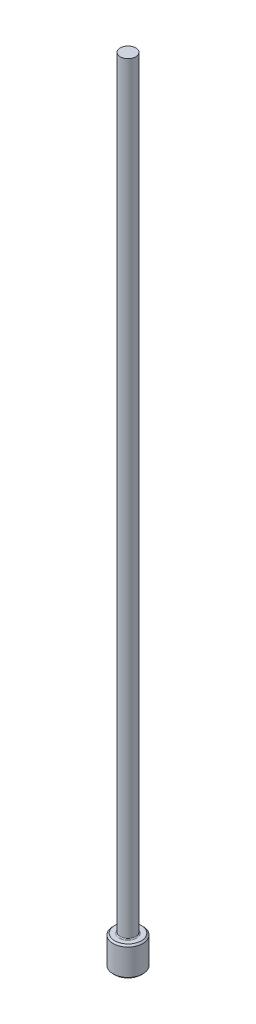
ISO-10303-21;
HEADER;
FILE_DESCRIPTION(('STEP AP214'),'2;1');
FILE_NAME('part.step','',(''),(''),'','','');
FILE_SCHEMA(('AUTOMOTIVE_DESIGN { 1 0 10303 214 1 1 1 1 }'));
ENDSEC;
DATA;
#1=APPLICATION_CONTEXT('core data for automotive mechanical design processes');
#2=APPLICATION_PROTOCOL_DEFINITION('international standard','automotive_design',2000,#1);
#3=PRODUCT_CONTEXT('',#1,'mechanical');
#4=PRODUCT('Part','Part','',(#3));
#5=PRODUCT_RELATED_PRODUCT_CATEGORY('part','',(#4));
#6=PRODUCT_DEFINITION_FORMATION('','',#4);
#7=PRODUCT_DEFINITION_CONTEXT('part definition',#1,'design');
#8=PRODUCT_DEFINITION('design','',#6,#7);
#9=PRODUCT_DEFINITION_SHAPE('','',#8);
#10=(LENGTH_UNIT() NAMED_UNIT(*) SI_UNIT(.MILLI.,.METRE.));
#11=(NAMED_UNIT(*) PLANE_ANGLE_UNIT() SI_UNIT($,.RADIAN.));
#12=(NAMED_UNIT(*) SI_UNIT($,.STERADIAN.) SOLID_ANGLE_UNIT());
#13=UNCERTAINTY_MEASURE_WITH_UNIT(LENGTH_MEASURE(1.E-05),#10,'distance_accuracy_value','');
#14=(GEOMETRIC_REPRESENTATION_CONTEXT(3) GLOBAL_UNCERTAINTY_ASSIGNED_CONTEXT((#13)) GLOBAL_UNIT_ASSIGNED_CONTEXT((#10,
#11,#12)) REPRESENTATION_CONTEXT('',''));
#15=CARTESIAN_POINT('',(0.,0.,0.));
#16=DIRECTION('',(0.,0.,1.));
#17=DIRECTION('',(1.,0.,0.));
#18=AXIS2_PLACEMENT_3D('',#15,#16,#17);
#19=CARTESIAN_POINT('',(0.,0.,0.));
#20=DIRECTION('',(0.,-1.,0.));
#21=DIRECTION('',(0.,0.,-1.));
#22=AXIS2_PLACEMENT_3D('',#19,#20,#21);
#23=PLANE('',#22);
#24=CARTESIAN_POINT('',(0.,0.,0.));
#25=DIRECTION('',(0.,-1.,0.));
#26=DIRECTION('',(0.,0.,-1.));
#27=AXIS2_PLACEMENT_3D('',#24,#25,#26);
#28=CIRCLE('',#27,1.06679999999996);
#29=CARTESIAN_POINT('',(0.,0.,-1.06679999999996));
#30=VERTEX_POINT('',#29);
#31=EDGE_CURVE('E46',#30,#30,#28,.T.);
#32=ORIENTED_EDGE('',*,*,#31,.T.);
#33=EDGE_LOOP('',(#32));
#34=FACE_BOUND('',#33,.T.);
#35=ADVANCED_FACE('F35',(#34),#23,.T.);
#36=CARTESIAN_POINT('',(0.,259.958771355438,0.));
#37=DIRECTION('',(0.,1.,0.));
#38=DIRECTION('',(0.,0.,1.));
#39=AXIS2_PLACEMENT_3D('',#36,#37,#38);
#40=CYLINDRICAL_SURFACE('',#39,1.19379999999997);
#41=CARTESIAN_POINT('',(0.,2.23519999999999,0.));
#42=DIRECTION('',(0.,1.,0.));
#43=DIRECTION('',(0.,0.,1.));
#44=AXIS2_PLACEMENT_3D('',#41,#42,#43);
#45=CIRCLE('',#44,1.19379999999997);
#46=CARTESIAN_POINT('',(0.,2.23519999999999,1.19379999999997));
#47=VERTEX_POINT('',#46);
#48=EDGE_CURVE('E50',#47,#47,#45,.F.);
#49=ORIENTED_EDGE('',*,*,#48,.T.);
#50=EDGE_LOOP('',(#49));
#51=FACE_BOUND('',#50,.T.);
#52=CARTESIAN_POINT('',(0.,0.126999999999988,0.));
#53=DIRECTION('',(0.,-1.,0.));
#54=DIRECTION('',(0.,0.,-1.));
#55=AXIS2_PLACEMENT_3D('',#52,#53,#54);
#56=CIRCLE('',#55,1.19379999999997);
#57=CARTESIAN_POINT('',(0.,0.126999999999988,-1.19379999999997));
#58=VERTEX_POINT('',#57);
#59=EDGE_CURVE('E55',#58,#58,#56,.F.);
#60=ORIENTED_EDGE('',*,*,#59,.T.);
#61=EDGE_LOOP('',(#60));
#62=FACE_BOUND('',#61,.T.);
#63=ADVANCED_FACE('F77',(#51,#62),#40,.T.);
#64=CARTESIAN_POINT('',(-1.19379999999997,2.3622,0.));
#65=DIRECTION('',(0.,1.,0.));
#66=DIRECTION('',(0.,0.,1.));
#67=AXIS2_PLACEMENT_3D('',#64,#65,#66);
#68=PLANE('',#67);
#69=CARTESIAN_POINT('',(0.,2.3622,0.));
#70=DIRECTION('',(0.,1.,0.));
#71=DIRECTION('',(0.,0.,1.));
#72=AXIS2_PLACEMENT_3D('',#69,#70,#71);
#73=CIRCLE('',#72,0.698499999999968);
#74=CARTESIAN_POINT('',(0.,2.3622,0.698499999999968));
#75=VERTEX_POINT('',#74);
#76=EDGE_CURVE('E10',#75,#75,#73,.F.);
#77=ORIENTED_EDGE('',*,*,#76,.T.);
#78=EDGE_LOOP('',(#77));
#79=FACE_BOUND('',#78,.T.);
#80=CARTESIAN_POINT('',(0.,2.3622,0.));
#81=DIRECTION('',(0.,1.,0.));
#82=DIRECTION('',(0.,0.,1.));
#83=AXIS2_PLACEMENT_3D('',#80,#81,#82);
#84=CIRCLE('',#83,1.06679999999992);
#85=CARTESIAN_POINT('',(0.,2.3622,1.06679999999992));
#86=VERTEX_POINT('',#85);
#87=EDGE_CURVE('E58',#86,#86,#84,.T.);
#88=ORIENTED_EDGE('',*,*,#87,.T.);
#89=EDGE_LOOP('',(#88));
#90=FACE_BOUND('',#89,.T.);
#91=ADVANCED_FACE('F69',(#79,#90),#68,.T.);
#92=CARTESIAN_POINT('',(0.,259.958771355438,0.));
#93=DIRECTION('',(0.,1.,0.));
#94=DIRECTION('',(0.,0.,1.));
#95=AXIS2_PLACEMENT_3D('',#92,#93,#94);
#96=CYLINDRICAL_SURFACE('',#95,0.622299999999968);
#97=CARTESIAN_POINT('',(0.,2.43840000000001,0.));
#98=DIRECTION('',(0.,1.,0.));
#99=DIRECTION('',(0.,0.,1.));
#100=AXIS2_PLACEMENT_3D('',#97,#98,#99);
#101=CIRCLE('',#100,0.622299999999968);
#102=CARTESIAN_POINT('',(0.,2.43840000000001,0.622299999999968));
#103=VERTEX_POINT('',#102);
#104=EDGE_CURVE('E42',#103,#103,#101,.T.);
#105=ORIENTED_EDGE('',*,*,#104,.T.);
#106=EDGE_LOOP('',(#105));
#107=FACE_BOUND('',#106,.T.);
#108=CARTESIAN_POINT('',(0.,63.5,0.));
#109=DIRECTION('',(0.,1.,0.));
#110=DIRECTION('',(0.,0.,1.));
#111=AXIS2_PLACEMENT_3D('',#108,#109,#110);
#112=CIRCLE('',#111,0.622299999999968);
#113=CARTESIAN_POINT('',(0.,63.5,0.622299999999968));
#114=VERTEX_POINT('',#113);
#115=EDGE_CURVE('E61',#114,#114,#112,.T.);
#116=ORIENTED_EDGE('',*,*,#115,.F.);
#117=EDGE_LOOP('',(#116));
#118=FACE_BOUND('',#117,.T.);
#119=ADVANCED_FACE('F67',(#107,#118),#96,.T.);
#120=CARTESIAN_POINT('',(-0.622299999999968,63.5,0.));
#121=DIRECTION('',(0.,1.,0.));
#122=DIRECTION('',(0.,0.,1.));
#123=AXIS2_PLACEMENT_3D('',#120,#121,#122);
#124=PLANE('',#123);
#125=ORIENTED_EDGE('',*,*,#115,.T.);
#126=EDGE_LOOP('',(#125));
#127=FACE_BOUND('',#126,.T.);
#128=ADVANCED_FACE('F65',(#127),#124,.T.);
#129=CARTESIAN_POINT('',(0.,2.36219999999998,0.));
#130=DIRECTION('',(0.,-1.,0.));
#131=DIRECTION('',(0.,0.,-1.));
#132=AXIS2_PLACEMENT_3D('',#129,#130,#131);
#133=CONICAL_SURFACE('',#132,1.06679999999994,0.785398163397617);
#134=ORIENTED_EDGE('',*,*,#48,.F.);
#135=EDGE_LOOP('',(#134));
#136=FACE_BOUND('',#135,.T.);
#137=ORIENTED_EDGE('',*,*,#87,.F.);
#138=EDGE_LOOP('',(#137));
#139=FACE_BOUND('',#138,.T.);
#140=ADVANCED_FACE('F75',(#136,#139),#133,.T.);
#141=CARTESIAN_POINT('',(0.,0.126999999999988,0.));
#142=DIRECTION('',(0.,1.,0.));
#143=DIRECTION('',(0.,0.,1.));
#144=AXIS2_PLACEMENT_3D('',#141,#142,#143);
#145=CONICAL_SURFACE('',#144,1.19379999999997,0.785398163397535);
#146=ORIENTED_EDGE('',*,*,#31,.F.);
#147=EDGE_LOOP('',(#146));
#148=FACE_BOUND('',#147,.T.);
#149=ORIENTED_EDGE('',*,*,#59,.F.);
#150=EDGE_LOOP('',(#149));
#151=FACE_BOUND('',#150,.T.);
#152=ADVANCED_FACE('F89',(#148,#151),#145,.T.);
#153=CARTESIAN_POINT('',(0.,2.43840000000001,0.));
#154=DIRECTION('',(0.,1.,0.));
#155=DIRECTION('',(0.,0.,1.));
#156=AXIS2_PLACEMENT_3D('',#153,#154,#155);
#157=TOROIDAL_SURFACE('',#156,0.698499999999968,0.0762);
#158=ORIENTED_EDGE('',*,*,#76,.F.);
#159=EDGE_LOOP('',(#158));
#160=FACE_BOUND('',#159,.T.);
#161=ORIENTED_EDGE('',*,*,#104,.F.);
#162=EDGE_LOOP('',(#161));
#163=FACE_BOUND('',#162,.T.);
#164=ADVANCED_FACE('F37',(#160,#163),#157,.F.);
#165=CLOSED_SHELL('',(#35,#63,#91,#119,#128,#140,#152,#164));
#166=MANIFOLD_SOLID_BREP('B2',#165);
#167=ADVANCED_BREP_SHAPE_REPRESENTATION('',(#18,#166),#14);
#168=SHAPE_DEFINITION_REPRESENTATION(#9,#167);
ENDSEC;
END-ISO-10303-21;
